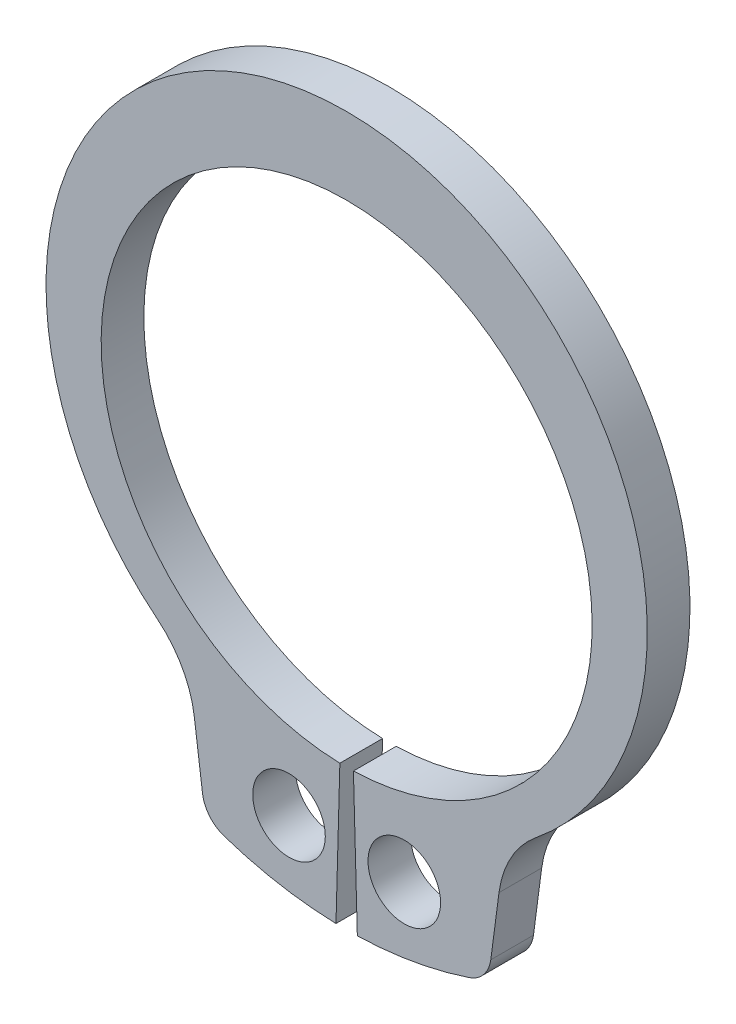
from build123d import *

# Parameters (mm, degrees)
BODYSKE_R  = 0.85
BODY_DEPTH = 1


with BuildPart() as part:
    # BodySke → Body (new body)
    with BuildSketch(Plane.XY):
        with BuildLine():
            Line((0.158839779, -5.747805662), (0.25, -9.046546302))
            ThreePointArc((0.25, -9.046546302), (1.577173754, -8.9115107), (2.870077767, -8.582840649))
            ThreePointArc((2.870077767, -8.582840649), (3.210901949, -8.348665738), (3.375809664, -7.969450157))
            Line((3.375809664, -7.969450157), (3.567937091, -6.510097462))
            ThreePointArc((3.567937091, -6.510097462), (3.852773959, -5.652106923), (4.435031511, -4.960546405))
            ThreePointArc((4.435031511, -4.960546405), (0, 7.55), (-4.435031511, -4.960546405))
            ThreePointArc((-4.435031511, -4.960546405), (-3.852773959, -5.652106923), (-3.567937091, -6.510097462))
            Line((-3.567937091, -6.510097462), (-3.375809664, -7.969450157))
            ThreePointArc((-3.375809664, -7.969450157), (-3.210901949, -8.348665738), (-2.870077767, -8.582840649))
            ThreePointArc((-2.870077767, -8.582840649), (-1.577173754, -8.9115107), (-0.25, -9.046546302))
            Line((-0.25, -9.046546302), (-0.158839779, -5.747805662))
            ThreePointArc((-0.158839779, -5.747805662), (0, 5.75), (0.158839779, -5.747805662))
        make_face()
        with Locations((1.35, -7.402913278)):
            Circle(BODYSKE_R, mode=Mode.SUBTRACT)
        with Locations((-1.35, -7.402913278)):
            Circle(BODYSKE_R, mode=Mode.SUBTRACT)
    extrude(amount=-BODY_DEPTH)


solid = part.part
